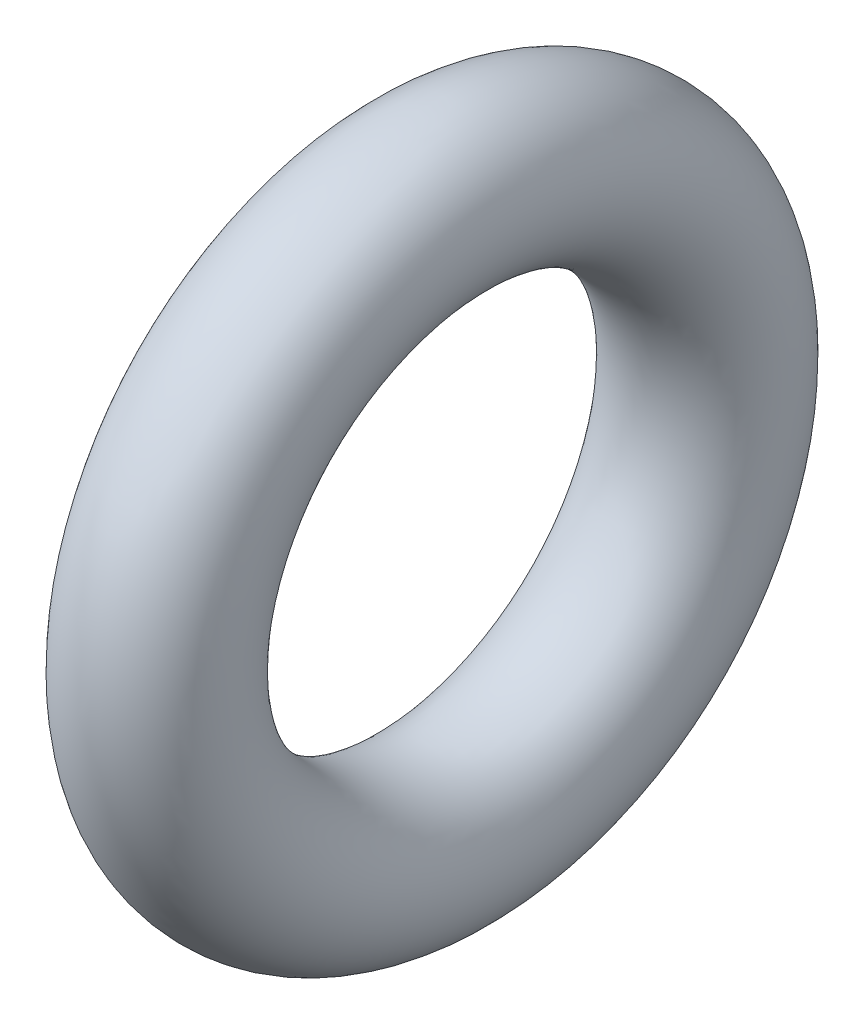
from build123d import *

# Parameters (mm, degrees)
SKETCH1_R = 0.889


with BuildPart() as part:
    # Sketch1 → Base-Revolve (revolve)
    with BuildSketch(Plane.XY, mode=Mode.PRIVATE) as base_revolve_sk:
        with Locations((0, 3.1242)):
            Circle(SKETCH1_R)
    revolve(base_revolve_sk.sketch.rotate(Axis((0, 0, 0), (1, 0, 0)), 90), axis=Axis((0, 0, 0), (1, 0, 0)))


solid = part.part
